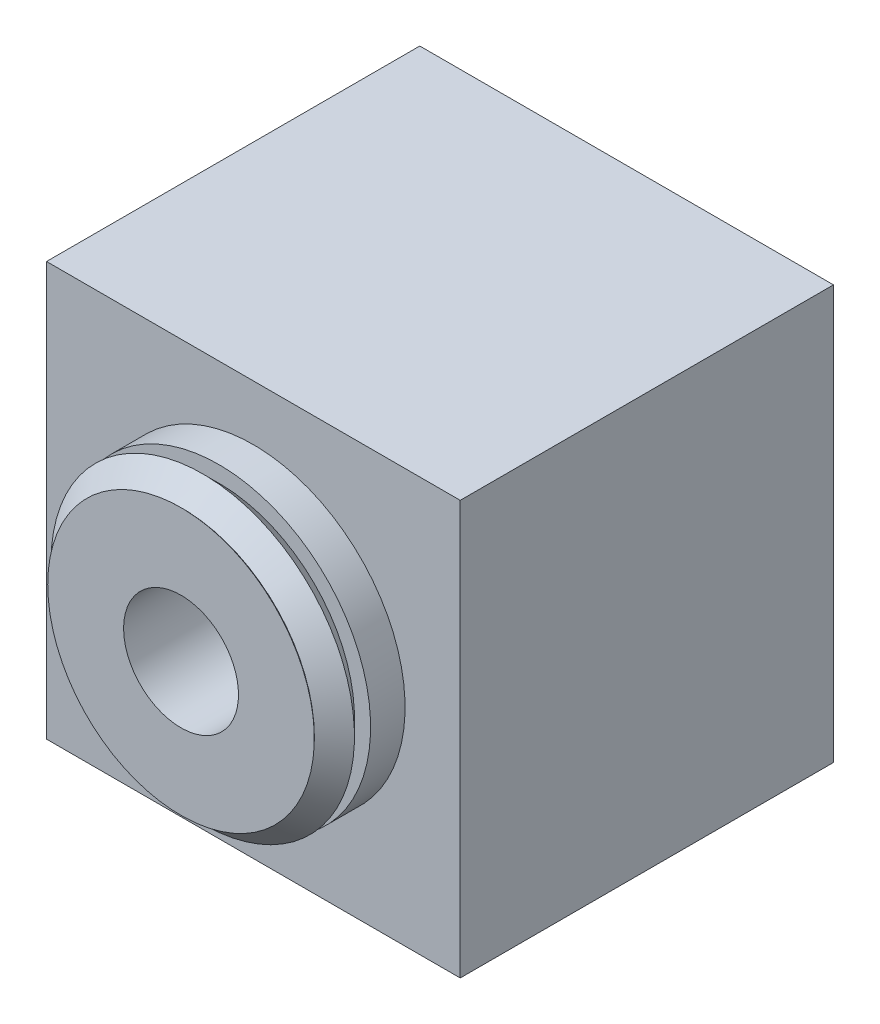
ISO-10303-21;
HEADER;
FILE_DESCRIPTION(('STEP AP214'),'2;1');
FILE_NAME('part.step','',(''),(''),'','','');
FILE_SCHEMA(('AUTOMOTIVE_DESIGN { 1 0 10303 214 1 1 1 1 }'));
ENDSEC;
DATA;
#1=APPLICATION_CONTEXT('core data for automotive mechanical design processes');
#2=APPLICATION_PROTOCOL_DEFINITION('international standard','automotive_design',2000,#1);
#3=PRODUCT_CONTEXT('',#1,'mechanical');
#4=PRODUCT('Part','Part','',(#3));
#5=PRODUCT_RELATED_PRODUCT_CATEGORY('part','',(#4));
#6=PRODUCT_DEFINITION_FORMATION('','',#4);
#7=PRODUCT_DEFINITION_CONTEXT('part definition',#1,'design');
#8=PRODUCT_DEFINITION('design','',#6,#7);
#9=PRODUCT_DEFINITION_SHAPE('','',#8);
#10=(LENGTH_UNIT() NAMED_UNIT(*) SI_UNIT(.MILLI.,.METRE.));
#11=(NAMED_UNIT(*) PLANE_ANGLE_UNIT() SI_UNIT($,.RADIAN.));
#12=(NAMED_UNIT(*) SI_UNIT($,.STERADIAN.) SOLID_ANGLE_UNIT());
#13=UNCERTAINTY_MEASURE_WITH_UNIT(LENGTH_MEASURE(1.E-05),#10,'distance_accuracy_value','');
#14=(GEOMETRIC_REPRESENTATION_CONTEXT(3) GLOBAL_UNCERTAINTY_ASSIGNED_CONTEXT((#13)) GLOBAL_UNIT_ASSIGNED_CONTEXT((#10,
#11,#12)) REPRESENTATION_CONTEXT('',''));
#15=CARTESIAN_POINT('',(0.,0.,0.));
#16=DIRECTION('',(0.,0.,1.));
#17=DIRECTION('',(1.,0.,0.));
#18=AXIS2_PLACEMENT_3D('',#15,#16,#17);
#19=CARTESIAN_POINT('',(0.,0.,0.));
#20=DIRECTION('',(0.,0.,1.));
#21=DIRECTION('',(1.,0.,0.));
#22=AXIS2_PLACEMENT_3D('',#19,#20,#21);
#23=PLANE('',#22);
#24=CARTESIAN_POINT('',(0.,0.,0.));
#25=DIRECTION('',(0.,0.,-1.));
#26=DIRECTION('',(-1.,0.,0.));
#27=AXIS2_PLACEMENT_3D('',#24,#25,#26);
#28=CIRCLE('',#27,7.366);
#29=CARTESIAN_POINT('',(-7.366,0.,0.));
#30=VERTEX_POINT('',#29);
#31=EDGE_CURVE('E11',#30,#30,#28,.T.);
#32=ORIENTED_EDGE('',*,*,#31,.F.);
#33=EDGE_LOOP('',(#32));
#34=FACE_BOUND('',#33,.T.);
#35=CARTESIAN_POINT('',(0.,0.,0.));
#36=DIRECTION('',(0.,0.,-1.));
#37=DIRECTION('',(-1.,0.,0.));
#38=AXIS2_PLACEMENT_3D('',#35,#36,#37);
#39=CIRCLE('',#38,3.175);
#40=CARTESIAN_POINT('',(-3.175,0.,0.));
#41=VERTEX_POINT('',#40);
#42=EDGE_CURVE('E149',#41,#41,#39,.T.);
#43=ORIENTED_EDGE('',*,*,#42,.T.);
#44=EDGE_LOOP('',(#43));
#45=FACE_BOUND('',#44,.T.);
#46=ADVANCED_FACE('F32',(#34,#45),#23,.T.);
#47=CARTESIAN_POINT('',(0.,0.,-26.197814));
#48=DIRECTION('',(0.,0.,-1.));
#49=DIRECTION('',(-1.,0.,0.));
#50=AXIS2_PLACEMENT_3D('',#47,#48,#49);
#51=PLANE('',#50);
#52=CARTESIAN_POINT('',(0.,0.,-26.197814));
#53=DIRECTION('',(0.,0.,-1.));
#54=DIRECTION('',(-1.,0.,0.));
#55=AXIS2_PLACEMENT_3D('',#52,#53,#54);
#56=CIRCLE('',#55,6.35);
#57=CARTESIAN_POINT('',(-6.35,0.,-26.197814));
#58=VERTEX_POINT('',#57);
#59=EDGE_CURVE('E157',#58,#58,#56,.T.);
#60=ORIENTED_EDGE('',*,*,#59,.T.);
#61=EDGE_LOOP('',(#60));
#62=FACE_BOUND('',#61,.T.);
#63=CARTESIAN_POINT('',(0.,0.,-26.197814));
#64=DIRECTION('',(0.,0.,-1.));
#65=DIRECTION('',(-1.,0.,0.));
#66=AXIS2_PLACEMENT_3D('',#63,#64,#65);
#67=CIRCLE('',#66,3.175);
#68=CARTESIAN_POINT('',(-3.175,0.,-26.197814));
#69=VERTEX_POINT('',#68);
#70=EDGE_CURVE('E151',#69,#69,#67,.T.);
#71=ORIENTED_EDGE('',*,*,#70,.F.);
#72=EDGE_LOOP('',(#71));
#73=FACE_BOUND('',#72,.T.);
#74=ADVANCED_FACE('F136',(#62,#73),#51,.T.);
#75=CARTESIAN_POINT('',(11.43,-11.43,-24.623014));
#76=DIRECTION('',(0.,0.,-1.));
#77=DIRECTION('',(-1.,0.,0.));
#78=AXIS2_PLACEMENT_3D('',#75,#76,#77);
#79=PLANE('',#78);
#80=DIRECTION('',(0.,-1.,0.));
#81=VECTOR('',#80,1.);
#82=CARTESIAN_POINT('',(11.43,11.43,-24.623014));
#83=LINE('',#82,#81);
#84=CARTESIAN_POINT('',(11.43,11.43,-24.623014));
#85=VERTEX_POINT('',#84);
#86=CARTESIAN_POINT('',(11.43,-11.43,-24.623014));
#87=VERTEX_POINT('',#86);
#88=EDGE_CURVE('E85',#85,#87,#83,.T.);
#89=ORIENTED_EDGE('',*,*,#88,.T.);
#90=DIRECTION('',(-1.,0.,0.));
#91=VECTOR('',#90,1.);
#92=CARTESIAN_POINT('',(11.43,-11.43,-24.623014));
#93=LINE('',#92,#91);
#94=CARTESIAN_POINT('',(-11.43,-11.43,-24.623014));
#95=VERTEX_POINT('',#94);
#96=EDGE_CURVE('E79',#87,#95,#93,.T.);
#97=ORIENTED_EDGE('',*,*,#96,.T.);
#98=DIRECTION('',(0.,1.,0.));
#99=VECTOR('',#98,1.);
#100=CARTESIAN_POINT('',(-11.43,11.43,-24.623014));
#101=LINE('',#100,#99);
#102=CARTESIAN_POINT('',(-11.43,11.43,-24.623014));
#103=VERTEX_POINT('',#102);
#104=EDGE_CURVE('E83',#95,#103,#101,.T.);
#105=ORIENTED_EDGE('',*,*,#104,.T.);
#106=DIRECTION('',(1.,0.,0.));
#107=VECTOR('',#106,1.);
#108=CARTESIAN_POINT('',(11.43,11.43,-24.623014));
#109=LINE('',#108,#107);
#110=EDGE_CURVE('E48',#103,#85,#109,.T.);
#111=ORIENTED_EDGE('',*,*,#110,.T.);
#112=EDGE_LOOP('',(#89,#97,#105,#111));
#113=FACE_BOUND('',#112,.T.);
#114=CARTESIAN_POINT('',(-6.91818978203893,6.55219439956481,-24.623014));
#115=DIRECTION('',(0.,0.,-1.));
#116=DIRECTION('',(-1.,0.,0.));
#117=AXIS2_PLACEMENT_3D('',#114,#115,#116);
#118=CIRCLE('',#117,1.7272);
#119=CARTESIAN_POINT('',(-8.64538978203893,6.55219439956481,-24.623014));
#120=VERTEX_POINT('',#119);
#121=EDGE_CURVE('E178',#120,#120,#118,.T.);
#122=ORIENTED_EDGE('',*,*,#121,.F.);
#123=EDGE_LOOP('',(#122));
#124=FACE_BOUND('',#123,.T.);
#125=CARTESIAN_POINT('',(6.5521943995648,-6.91818978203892,-24.623014));
#126=DIRECTION('',(0.,0.,-1.));
#127=DIRECTION('',(1.,0.,0.));
#128=AXIS2_PLACEMENT_3D('',#125,#126,#127);
#129=CIRCLE('',#128,1.7272);
#130=CARTESIAN_POINT('',(8.2793943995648,-6.91818978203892,-24.623014));
#131=VERTEX_POINT('',#130);
#132=EDGE_CURVE('E172',#131,#131,#129,.T.);
#133=ORIENTED_EDGE('',*,*,#132,.F.);
#134=EDGE_LOOP('',(#133));
#135=FACE_BOUND('',#134,.T.);
#136=CARTESIAN_POINT('',(0.,0.,-24.623014));
#137=DIRECTION('',(0.,0.,-1.));
#138=DIRECTION('',(-1.,0.,0.));
#139=AXIS2_PLACEMENT_3D('',#136,#137,#138);
#140=CIRCLE('',#139,6.35);
#141=CARTESIAN_POINT('',(-6.35,0.,-24.623014));
#142=VERTEX_POINT('',#141);
#143=EDGE_CURVE('E154',#142,#142,#140,.T.);
#144=ORIENTED_EDGE('',*,*,#143,.F.);
#145=EDGE_LOOP('',(#144));
#146=FACE_BOUND('',#145,.T.);
#147=ADVANCED_FACE('F80',(#113,#124,#135,#146),#79,.T.);
#148=CARTESIAN_POINT('',(0.,0.,-0.0927099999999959));
#149=DIRECTION('',(0.,0.,1.));
#150=DIRECTION('',(1.,0.,0.));
#151=AXIS2_PLACEMENT_3D('',#148,#149,#150);
#152=CONICAL_SURFACE('',#151,7.27329,0.785398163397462);
#153=ORIENTED_EDGE('',*,*,#31,.T.);
#154=EDGE_LOOP('',(#153));
#155=FACE_BOUND('',#154,.T.);
#156=CARTESIAN_POINT('',(0.,0.,-0.0927099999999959));
#157=DIRECTION('',(0.,0.,-1.));
#158=DIRECTION('',(-1.,0.,0.));
#159=AXIS2_PLACEMENT_3D('',#156,#157,#158);
#160=CIRCLE('',#159,7.27329);
#161=CARTESIAN_POINT('',(-7.27329,0.,-0.0927099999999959));
#162=VERTEX_POINT('',#161);
#163=EDGE_CURVE('E40',#162,#162,#160,.T.);
#164=ORIENTED_EDGE('',*,*,#163,.F.);
#165=EDGE_LOOP('',(#164));
#166=FACE_BOUND('',#165,.T.);
#167=ADVANCED_FACE('F127',(#155,#166),#152,.T.);
#168=CARTESIAN_POINT('',(0.,0.,-1.20141999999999));
#169=DIRECTION('',(0.,0.,-1.));
#170=DIRECTION('',(-1.,0.,0.));
#171=AXIS2_PLACEMENT_3D('',#168,#169,#170);
#172=CONICAL_SURFACE('',#171,8.38199999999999,0.785398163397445);
#173=ORIENTED_EDGE('',*,*,#163,.T.);
#174=EDGE_LOOP('',(#173));
#175=FACE_BOUND('',#174,.T.);
#176=CARTESIAN_POINT('',(0.,0.,-1.20141999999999));
#177=DIRECTION('',(0.,0.,-1.));
#178=DIRECTION('',(-1.,0.,0.));
#179=AXIS2_PLACEMENT_3D('',#176,#177,#178);
#180=CIRCLE('',#179,8.38199999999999);
#181=CARTESIAN_POINT('',(-8.38199999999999,0.,-1.20141999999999));
#182=VERTEX_POINT('',#181);
#183=EDGE_CURVE('E119',#182,#182,#180,.T.);
#184=ORIENTED_EDGE('',*,*,#183,.F.);
#185=EDGE_LOOP('',(#184));
#186=FACE_BOUND('',#185,.T.);
#187=ADVANCED_FACE('F124',(#175,#186),#172,.T.);
#188=CARTESIAN_POINT('',(0.,0.,-2.093214));
#189=DIRECTION('',(0.,0.,1.));
#190=DIRECTION('',(1.,0.,0.));
#191=AXIS2_PLACEMENT_3D('',#188,#189,#190);
#192=CONICAL_SURFACE('',#191,7.49020599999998,0.785398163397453);
#193=ORIENTED_EDGE('',*,*,#183,.T.);
#194=EDGE_LOOP('',(#193));
#195=FACE_BOUND('',#194,.T.);
#196=CARTESIAN_POINT('',(0.,0.,-2.093214));
#197=DIRECTION('',(0.,0.,-1.));
#198=DIRECTION('',(-1.,0.,0.));
#199=AXIS2_PLACEMENT_3D('',#196,#197,#198);
#200=CIRCLE('',#199,7.49020599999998);
#201=CARTESIAN_POINT('',(-7.49020599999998,0.,-2.093214));
#202=VERTEX_POINT('',#201);
#203=EDGE_CURVE('E116',#202,#202,#200,.T.);
#204=ORIENTED_EDGE('',*,*,#203,.F.);
#205=EDGE_LOOP('',(#204));
#206=FACE_BOUND('',#205,.T.);
#207=ADVANCED_FACE('F134',(#195,#206),#192,.T.);
#208=CARTESIAN_POINT('',(0.,7.49020599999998,-2.093214));
#209=DIRECTION('',(0.,0.,1.));
#210=DIRECTION('',(1.,0.,0.));
#211=AXIS2_PLACEMENT_3D('',#208,#209,#210);
#212=PLANE('',#211);
#213=ORIENTED_EDGE('',*,*,#203,.T.);
#214=EDGE_LOOP('',(#213));
#215=FACE_BOUND('',#214,.T.);
#216=CARTESIAN_POINT('',(0.,0.,-2.093214));
#217=DIRECTION('',(0.,0.,-1.));
#218=DIRECTION('',(-1.,0.,0.));
#219=AXIS2_PLACEMENT_3D('',#216,#217,#218);
#220=CIRCLE('',#219,8.38199999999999);
#221=CARTESIAN_POINT('',(-8.38199999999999,0.,-2.093214));
#222=VERTEX_POINT('',#221);
#223=EDGE_CURVE('E113',#222,#222,#220,.T.);
#224=ORIENTED_EDGE('',*,*,#223,.F.);
#225=EDGE_LOOP('',(#224));
#226=FACE_BOUND('',#225,.T.);
#227=ADVANCED_FACE('F254',(#215,#226),#212,.T.);
#228=CARTESIAN_POINT('',(0.,0.,-71.2941240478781));
#229=DIRECTION('',(0.,0.,-1.));
#230=DIRECTION('',(-1.,0.,0.));
#231=AXIS2_PLACEMENT_3D('',#228,#229,#230);
#232=CYLINDRICAL_SURFACE('',#231,8.38199999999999);
#233=ORIENTED_EDGE('',*,*,#223,.T.);
#234=EDGE_LOOP('',(#233));
#235=FACE_BOUND('',#234,.T.);
#236=CARTESIAN_POINT('',(0.,0.,-3.998214));
#237=DIRECTION('',(0.,0.,-1.));
#238=DIRECTION('',(-1.,0.,0.));
#239=AXIS2_PLACEMENT_3D('',#236,#237,#238);
#240=CIRCLE('',#239,8.38199999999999);
#241=CARTESIAN_POINT('',(-8.38199999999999,0.,-3.998214));
#242=VERTEX_POINT('',#241);
#243=EDGE_CURVE('E110',#242,#242,#240,.T.);
#244=ORIENTED_EDGE('',*,*,#243,.F.);
#245=EDGE_LOOP('',(#244));
#246=FACE_BOUND('',#245,.T.);
#247=ADVANCED_FACE('F250',(#235,#246),#232,.T.);
#248=CARTESIAN_POINT('',(11.43,11.43,-24.623014));
#249=DIRECTION('',(-1.,0.,0.));
#250=DIRECTION('',(0.,0.,1.));
#251=AXIS2_PLACEMENT_3D('',#248,#249,#250);
#252=PLANE('',#251);
#253=DIRECTION('',(0.,-1.,0.));
#254=VECTOR('',#253,1.);
#255=CARTESIAN_POINT('',(11.43,11.43,-3.998214));
#256=LINE('',#255,#254);
#257=CARTESIAN_POINT('',(11.43,11.43,-3.998214));
#258=VERTEX_POINT('',#257);
#259=CARTESIAN_POINT('',(11.43,-11.43,-3.998214));
#260=VERTEX_POINT('',#259);
#261=EDGE_CURVE('E100',#258,#260,#256,.T.);
#262=ORIENTED_EDGE('',*,*,#261,.T.);
#263=DIRECTION('',(0.,0.,1.));
#264=VECTOR('',#263,1.);
#265=CARTESIAN_POINT('',(11.43,-11.43,-24.623014));
#266=LINE('',#265,#264);
#267=EDGE_CURVE('E91',#87,#260,#266,.T.);
#268=ORIENTED_EDGE('',*,*,#267,.F.);
#269=ORIENTED_EDGE('',*,*,#88,.F.);
#270=DIRECTION('',(0.,0.,1.));
#271=VECTOR('',#270,1.);
#272=CARTESIAN_POINT('',(11.43,11.43,-24.623014));
#273=LINE('',#272,#271);
#274=EDGE_CURVE('E96',#85,#258,#273,.T.);
#275=ORIENTED_EDGE('',*,*,#274,.T.);
#276=EDGE_LOOP('',(#262,#268,#269,#275));
#277=FACE_BOUND('',#276,.T.);
#278=ADVANCED_FACE('F247',(#277),#252,.F.);
#279=CARTESIAN_POINT('',(11.43,-11.43,-24.623014));
#280=DIRECTION('',(0.,1.,0.));
#281=DIRECTION('',(0.,0.,1.));
#282=AXIS2_PLACEMENT_3D('',#279,#280,#281);
#283=PLANE('',#282);
#284=DIRECTION('',(-1.,0.,0.));
#285=VECTOR('',#284,1.);
#286=CARTESIAN_POINT('',(11.43,-11.43,-3.998214));
#287=LINE('',#286,#285);
#288=CARTESIAN_POINT('',(-11.43,-11.43,-3.998214));
#289=VERTEX_POINT('',#288);
#290=EDGE_CURVE('E90',#260,#289,#287,.T.);
#291=ORIENTED_EDGE('',*,*,#290,.T.);
#292=DIRECTION('',(0.,0.,1.));
#293=VECTOR('',#292,1.);
#294=CARTESIAN_POINT('',(-11.43,-11.43,-24.623014));
#295=LINE('',#294,#293);
#296=EDGE_CURVE('E88',#95,#289,#295,.T.);
#297=ORIENTED_EDGE('',*,*,#296,.F.);
#298=ORIENTED_EDGE('',*,*,#96,.F.);
#299=ORIENTED_EDGE('',*,*,#267,.T.);
#300=EDGE_LOOP('',(#291,#297,#298,#299));
#301=FACE_BOUND('',#300,.T.);
#302=ADVANCED_FACE('F89',(#301),#283,.F.);
#303=CARTESIAN_POINT('',(-11.43,11.43,-24.623014));
#304=DIRECTION('',(1.,0.,0.));
#305=DIRECTION('',(0.,1.,0.));
#306=AXIS2_PLACEMENT_3D('',#303,#304,#305);
#307=PLANE('',#306);
#308=CARTESIAN_POINT('',(-11.43,-5.5499,-18.273014));
#309=DIRECTION('',(-1.,0.,0.));
#310=DIRECTION('',(0.,-1.,0.));
#311=AXIS2_PLACEMENT_3D('',#308,#309,#310);
#312=CIRCLE('',#311,1.7272);
#313=CARTESIAN_POINT('',(-11.43,-7.2771,-18.273014));
#314=VERTEX_POINT('',#313);
#315=EDGE_CURVE('E160',#314,#314,#312,.T.);
#316=ORIENTED_EDGE('',*,*,#315,.F.);
#317=EDGE_LOOP('',(#316));
#318=FACE_BOUND('',#317,.T.);
#319=CARTESIAN_POINT('',(-11.43,5.5499,-7.17321400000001));
#320=DIRECTION('',(-1.,0.,0.));
#321=DIRECTION('',(0.,-1.,0.));
#322=AXIS2_PLACEMENT_3D('',#319,#320,#321);
#323=CIRCLE('',#322,1.7272);
#324=CARTESIAN_POINT('',(-11.43,3.8227,-7.17321400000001));
#325=VERTEX_POINT('',#324);
#326=EDGE_CURVE('E166',#325,#325,#323,.T.);
#327=ORIENTED_EDGE('',*,*,#326,.F.);
#328=EDGE_LOOP('',(#327));
#329=FACE_BOUND('',#328,.T.);
#330=DIRECTION('',(0.,1.,0.));
#331=VECTOR('',#330,1.);
#332=CARTESIAN_POINT('',(-11.43,11.43,-3.998214));
#333=LINE('',#332,#331);
#334=CARTESIAN_POINT('',(-11.43,11.43,-3.998214));
#335=VERTEX_POINT('',#334);
#336=EDGE_CURVE('E65',#289,#335,#333,.T.);
#337=ORIENTED_EDGE('',*,*,#336,.T.);
#338=DIRECTION('',(0.,0.,1.));
#339=VECTOR('',#338,1.);
#340=CARTESIAN_POINT('',(-11.43,11.43,-24.623014));
#341=LINE('',#340,#339);
#342=EDGE_CURVE('E92',#103,#335,#341,.T.);
#343=ORIENTED_EDGE('',*,*,#342,.F.);
#344=ORIENTED_EDGE('',*,*,#104,.F.);
#345=ORIENTED_EDGE('',*,*,#296,.T.);
#346=EDGE_LOOP('',(#337,#343,#344,#345));
#347=FACE_BOUND('',#346,.T.);
#348=ADVANCED_FACE('F94',(#318,#329,#347),#307,.F.);
#349=CARTESIAN_POINT('',(11.43,11.43,-24.623014));
#350=DIRECTION('',(0.,-1.,0.));
#351=DIRECTION('',(0.,0.,-1.));
#352=AXIS2_PLACEMENT_3D('',#349,#350,#351);
#353=PLANE('',#352);
#354=DIRECTION('',(1.,0.,0.));
#355=VECTOR('',#354,1.);
#356=CARTESIAN_POINT('',(11.43,11.43,-3.998214));
#357=LINE('',#356,#355);
#358=EDGE_CURVE('E71',#335,#258,#357,.T.);
#359=ORIENTED_EDGE('',*,*,#358,.T.);
#360=ORIENTED_EDGE('',*,*,#274,.F.);
#361=ORIENTED_EDGE('',*,*,#110,.F.);
#362=ORIENTED_EDGE('',*,*,#342,.T.);
#363=EDGE_LOOP('',(#359,#360,#361,#362));
#364=FACE_BOUND('',#363,.T.);
#365=ADVANCED_FACE('F238',(#364),#353,.F.);
#366=CARTESIAN_POINT('',(11.43,-11.43,-3.998214));
#367=DIRECTION('',(0.,0.,-1.));
#368=DIRECTION('',(-1.,0.,0.));
#369=AXIS2_PLACEMENT_3D('',#366,#367,#368);
#370=PLANE('',#369);
#371=ORIENTED_EDGE('',*,*,#243,.T.);
#372=EDGE_LOOP('',(#371));
#373=FACE_BOUND('',#372,.T.);
#374=ORIENTED_EDGE('',*,*,#261,.F.);
#375=ORIENTED_EDGE('',*,*,#358,.F.);
#376=ORIENTED_EDGE('',*,*,#336,.F.);
#377=ORIENTED_EDGE('',*,*,#290,.F.);
#378=EDGE_LOOP('',(#374,#375,#376,#377));
#379=FACE_BOUND('',#378,.T.);
#380=ADVANCED_FACE('F233',(#373,#379),#370,.F.);
#381=CARTESIAN_POINT('',(-6.91818978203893,6.55219439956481,-16.698214));
#382=DIRECTION('',(0.,0.,-1.));
#383=DIRECTION('',(-1.,0.,0.));
#384=AXIS2_PLACEMENT_3D('',#381,#382,#383);
#385=CYLINDRICAL_SURFACE('',#384,1.7272);
#386=CARTESIAN_POINT('',(-6.91818978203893,6.55219439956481,-16.698214));
#387=DIRECTION('',(0.,0.,-1.));
#388=DIRECTION('',(-1.,0.,0.));
#389=AXIS2_PLACEMENT_3D('',#386,#387,#388);
#390=CIRCLE('',#389,1.7272);
#391=CARTESIAN_POINT('',(-8.64538978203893,6.55219439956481,-16.698214));
#392=VERTEX_POINT('',#391);
#393=EDGE_CURVE('E103',#392,#392,#390,.T.);
#394=ORIENTED_EDGE('',*,*,#393,.F.);
#395=EDGE_LOOP('',(#394));
#396=FACE_BOUND('',#395,.T.);
#397=ORIENTED_EDGE('',*,*,#121,.T.);
#398=EDGE_LOOP('',(#397));
#399=FACE_BOUND('',#398,.T.);
#400=ADVANCED_FACE('F186',(#396,#399),#385,.F.);
#401=CARTESIAN_POINT('',(-6.91818978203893,6.55219439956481,-16.698214));
#402=DIRECTION('',(0.,0.,-1.));
#403=DIRECTION('',(-1.,0.,0.));
#404=AXIS2_PLACEMENT_3D('',#401,#402,#403);
#405=PLANE('',#404);
#406=ORIENTED_EDGE('',*,*,#393,.T.);
#407=EDGE_LOOP('',(#406));
#408=FACE_BOUND('',#407,.T.);
#409=ADVANCED_FACE('F227',(#408),#405,.T.);
#410=CARTESIAN_POINT('',(6.5521943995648,-6.91818978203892,-16.698214));
#411=DIRECTION('',(0.,0.,-1.));
#412=DIRECTION('',(-1.,0.,0.));
#413=AXIS2_PLACEMENT_3D('',#410,#411,#412);
#414=CYLINDRICAL_SURFACE('',#413,1.7272);
#415=CARTESIAN_POINT('',(6.5521943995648,-6.91818978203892,-16.698214));
#416=DIRECTION('',(0.,0.,-1.));
#417=DIRECTION('',(1.,0.,0.));
#418=AXIS2_PLACEMENT_3D('',#415,#416,#417);
#419=CIRCLE('',#418,1.7272);
#420=CARTESIAN_POINT('',(8.2793943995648,-6.91818978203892,-16.698214));
#421=VERTEX_POINT('',#420);
#422=EDGE_CURVE('E175',#421,#421,#419,.T.);
#423=ORIENTED_EDGE('',*,*,#422,.F.);
#424=EDGE_LOOP('',(#423));
#425=FACE_BOUND('',#424,.T.);
#426=ORIENTED_EDGE('',*,*,#132,.T.);
#427=EDGE_LOOP('',(#426));
#428=FACE_BOUND('',#427,.T.);
#429=ADVANCED_FACE('F223',(#425,#428),#414,.F.);
#430=CARTESIAN_POINT('',(6.5521943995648,-6.91818978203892,-16.698214));
#431=DIRECTION('',(0.,0.,1.));
#432=DIRECTION('',(1.,0.,0.));
#433=AXIS2_PLACEMENT_3D('',#430,#431,#432);
#434=PLANE('',#433);
#435=ORIENTED_EDGE('',*,*,#422,.T.);
#436=EDGE_LOOP('',(#435));
#437=FACE_BOUND('',#436,.T.);
#438=ADVANCED_FACE('F219',(#437),#434,.F.);
#439=CARTESIAN_POINT('',(-6.6802,5.5499,-7.17321400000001));
#440=DIRECTION('',(-1.,0.,0.));
#441=DIRECTION('',(0.,-1.,0.));
#442=AXIS2_PLACEMENT_3D('',#439,#440,#441);
#443=CYLINDRICAL_SURFACE('',#442,1.7272);
#444=CARTESIAN_POINT('',(-6.6802,5.5499,-7.17321400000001));
#445=DIRECTION('',(-1.,0.,0.));
#446=DIRECTION('',(0.,-1.,0.));
#447=AXIS2_PLACEMENT_3D('',#444,#445,#446);
#448=CIRCLE('',#447,1.7272);
#449=CARTESIAN_POINT('',(-6.6802,3.8227,-7.17321400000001));
#450=VERTEX_POINT('',#449);
#451=EDGE_CURVE('E169',#450,#450,#448,.T.);
#452=ORIENTED_EDGE('',*,*,#451,.F.);
#453=EDGE_LOOP('',(#452));
#454=FACE_BOUND('',#453,.T.);
#455=ORIENTED_EDGE('',*,*,#326,.T.);
#456=EDGE_LOOP('',(#455));
#457=FACE_BOUND('',#456,.T.);
#458=ADVANCED_FACE('F215',(#454,#457),#443,.F.);
#459=CARTESIAN_POINT('',(-6.6802,5.5499,-7.17321400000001));
#460=DIRECTION('',(-1.,0.,0.));
#461=DIRECTION('',(0.,-1.,0.));
#462=AXIS2_PLACEMENT_3D('',#459,#460,#461);
#463=PLANE('',#462);
#464=ORIENTED_EDGE('',*,*,#451,.T.);
#465=EDGE_LOOP('',(#464));
#466=FACE_BOUND('',#465,.T.);
#467=ADVANCED_FACE('F211',(#466),#463,.T.);
#468=CARTESIAN_POINT('',(-6.6802,-5.5499,-18.273014));
#469=DIRECTION('',(-1.,0.,0.));
#470=DIRECTION('',(0.,-1.,0.));
#471=AXIS2_PLACEMENT_3D('',#468,#469,#470);
#472=CYLINDRICAL_SURFACE('',#471,1.7272);
#473=CARTESIAN_POINT('',(-6.6802,-5.5499,-18.273014));
#474=DIRECTION('',(-1.,0.,0.));
#475=DIRECTION('',(0.,-1.,0.));
#476=AXIS2_PLACEMENT_3D('',#473,#474,#475);
#477=CIRCLE('',#476,1.7272);
#478=CARTESIAN_POINT('',(-6.6802,-7.2771,-18.273014));
#479=VERTEX_POINT('',#478);
#480=EDGE_CURVE('E163',#479,#479,#477,.T.);
#481=ORIENTED_EDGE('',*,*,#480,.F.);
#482=EDGE_LOOP('',(#481));
#483=FACE_BOUND('',#482,.T.);
#484=ORIENTED_EDGE('',*,*,#315,.T.);
#485=EDGE_LOOP('',(#484));
#486=FACE_BOUND('',#485,.T.);
#487=ADVANCED_FACE('F204',(#483,#486),#472,.F.);
#488=CARTESIAN_POINT('',(-6.6802,-5.5499,-18.273014));
#489=DIRECTION('',(-1.,0.,0.));
#490=DIRECTION('',(0.,-1.,0.));
#491=AXIS2_PLACEMENT_3D('',#488,#489,#490);
#492=PLANE('',#491);
#493=ORIENTED_EDGE('',*,*,#480,.T.);
#494=EDGE_LOOP('',(#493));
#495=FACE_BOUND('',#494,.T.);
#496=ADVANCED_FACE('F195',(#495),#492,.T.);
#497=CARTESIAN_POINT('',(0.,0.,-26.197814));
#498=DIRECTION('',(0.,0.,1.));
#499=DIRECTION('',(1.,0.,0.));
#500=AXIS2_PLACEMENT_3D('',#497,#498,#499);
#501=CYLINDRICAL_SURFACE('',#500,6.35);
#502=ORIENTED_EDGE('',*,*,#59,.F.);
#503=EDGE_LOOP('',(#502));
#504=FACE_BOUND('',#503,.T.);
#505=ORIENTED_EDGE('',*,*,#143,.T.);
#506=EDGE_LOOP('',(#505));
#507=FACE_BOUND('',#506,.T.);
#508=ADVANCED_FACE('F192',(#504,#507),#501,.T.);
#509=CARTESIAN_POINT('',(0.,0.,-26.197814));
#510=DIRECTION('',(0.,0.,1.));
#511=DIRECTION('',(1.,0.,0.));
#512=AXIS2_PLACEMENT_3D('',#509,#510,#511);
#513=CYLINDRICAL_SURFACE('',#512,3.175);
#514=ORIENTED_EDGE('',*,*,#70,.T.);
#515=EDGE_LOOP('',(#514));
#516=FACE_BOUND('',#515,.T.);
#517=ORIENTED_EDGE('',*,*,#42,.F.);
#518=EDGE_LOOP('',(#517));
#519=FACE_BOUND('',#518,.T.);
#520=ADVANCED_FACE('F194',(#516,#519),#513,.F.);
#521=CLOSED_SHELL('',(#46,#74,#147,#167,#187,#207,#227,#247,#278,#302,#348,#365,#380,#400,#409,
#429,#438,#458,#467,#487,#496,#508,#520));
#522=MANIFOLD_SOLID_BREP('B2',#521);
#523=ADVANCED_BREP_SHAPE_REPRESENTATION('',(#18,#522),#14);
#524=SHAPE_DEFINITION_REPRESENTATION(#9,#523);
ENDSEC;
END-ISO-10303-21;
